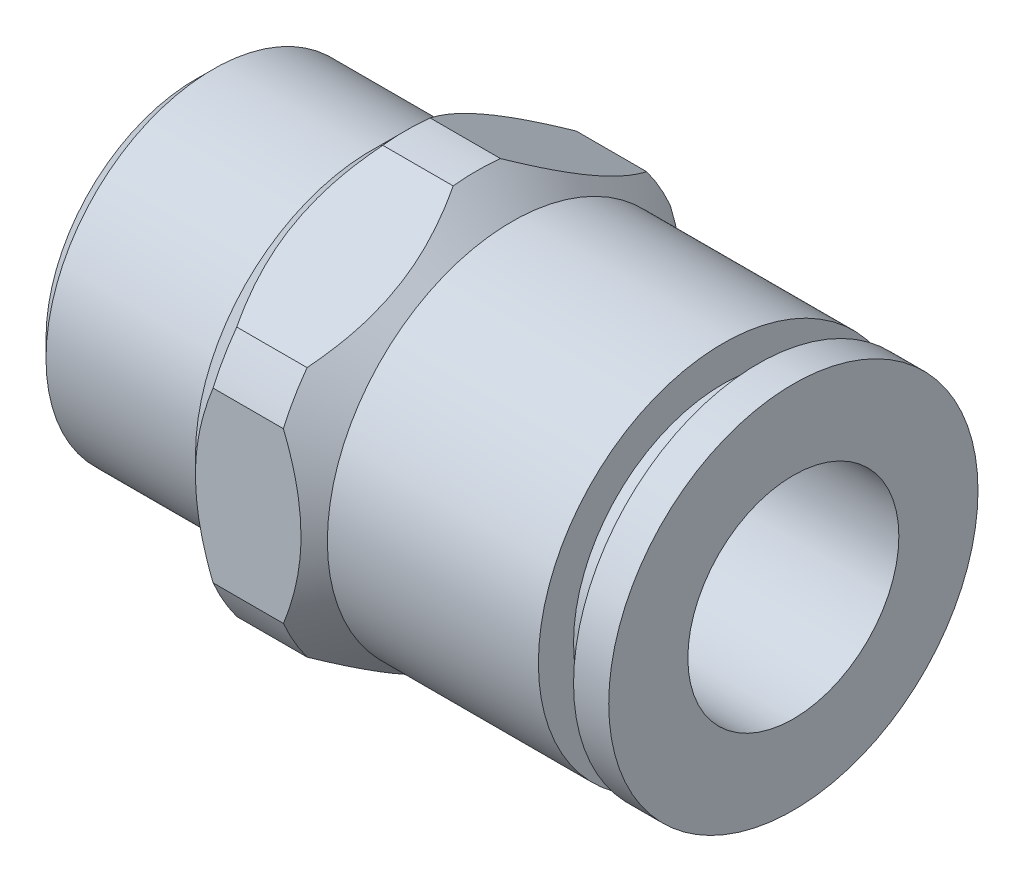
ISO-10303-21;
HEADER;
FILE_DESCRIPTION(('STEP AP214'),'2;1');
FILE_NAME('part.step','',(''),(''),'','','');
FILE_SCHEMA(('AUTOMOTIVE_DESIGN { 1 0 10303 214 1 1 1 1 }'));
ENDSEC;
DATA;
#1=APPLICATION_CONTEXT('core data for automotive mechanical design processes');
#2=APPLICATION_PROTOCOL_DEFINITION('international standard','automotive_design',2000,#1);
#3=PRODUCT_CONTEXT('',#1,'mechanical');
#4=PRODUCT('Part','Part','',(#3));
#5=PRODUCT_RELATED_PRODUCT_CATEGORY('part','',(#4));
#6=PRODUCT_DEFINITION_FORMATION('','',#4);
#7=PRODUCT_DEFINITION_CONTEXT('part definition',#1,'design');
#8=PRODUCT_DEFINITION('design','',#6,#7);
#9=PRODUCT_DEFINITION_SHAPE('','',#8);
#10=(LENGTH_UNIT() NAMED_UNIT(*) SI_UNIT(.MILLI.,.METRE.));
#11=(NAMED_UNIT(*) PLANE_ANGLE_UNIT() SI_UNIT($,.RADIAN.));
#12=(NAMED_UNIT(*) SI_UNIT($,.STERADIAN.) SOLID_ANGLE_UNIT());
#13=UNCERTAINTY_MEASURE_WITH_UNIT(LENGTH_MEASURE(1.E-05),#10,'distance_accuracy_value','');
#14=(GEOMETRIC_REPRESENTATION_CONTEXT(3) GLOBAL_UNCERTAINTY_ASSIGNED_CONTEXT((#13)) GLOBAL_UNIT_ASSIGNED_CONTEXT((#10,
#11,#12)) REPRESENTATION_CONTEXT('',''));
#15=CARTESIAN_POINT('',(0.,0.,0.));
#16=DIRECTION('',(0.,0.,1.));
#17=DIRECTION('',(1.,0.,0.));
#18=AXIS2_PLACEMENT_3D('',#15,#16,#17);
#19=CARTESIAN_POINT('',(-51.6037974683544,0.,0.));
#20=DIRECTION('',(-1.,0.,0.));
#21=DIRECTION('',(0.,0.,1.));
#22=AXIS2_PLACEMENT_3D('',#19,#20,#21);
#23=CYLINDRICAL_SURFACE('',#22,6.);
#24=CARTESIAN_POINT('',(-2.,0.,0.));
#25=DIRECTION('',(-1.,0.,0.));
#26=DIRECTION('',(0.,0.,1.));
#27=AXIS2_PLACEMENT_3D('',#24,#25,#26);
#28=CIRCLE('',#27,6.);
#29=CARTESIAN_POINT('',(-2.,-2.39791576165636,-5.5));
#30=VERTEX_POINT('',#29);
#31=CARTESIAN_POINT('',(-2.,-3.56418183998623,-4.82665596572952));
#32=VERTEX_POINT('',#31);
#33=EDGE_CURVE('E143',#30,#32,#28,.T.);
#34=ORIENTED_EDGE('',*,*,#33,.T.);
#35=DIRECTION('',(-1.,0.,0.));
#36=VECTOR('',#35,1.);
#37=CARTESIAN_POINT('',(-51.6037974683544,-3.56418183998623,-4.82665596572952));
#38=LINE('',#37,#36);
#39=CARTESIAN_POINT('',(-4.,-3.56418183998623,-4.82665596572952));
#40=VERTEX_POINT('',#39);
#41=EDGE_CURVE('E382',#32,#40,#38,.T.);
#42=ORIENTED_EDGE('',*,*,#41,.T.);
#43=CARTESIAN_POINT('',(-4.,0.,0.));
#44=DIRECTION('',(-1.,0.,0.));
#45=DIRECTION('',(0.,0.,1.));
#46=AXIS2_PLACEMENT_3D('',#43,#44,#45);
#47=CIRCLE('',#46,6.);
#48=CARTESIAN_POINT('',(-4.,-2.39791576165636,-5.5));
#49=VERTEX_POINT('',#48);
#50=EDGE_CURVE('E145',#49,#40,#47,.T.);
#51=ORIENTED_EDGE('',*,*,#50,.F.);
#52=DIRECTION('',(-1.,0.,0.));
#53=VECTOR('',#52,1.);
#54=CARTESIAN_POINT('',(-51.6037974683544,-2.39791576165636,-5.5));
#55=LINE('',#54,#53);
#56=EDGE_CURVE('E128',#49,#30,#55,.F.);
#57=ORIENTED_EDGE('',*,*,#56,.T.);
#58=EDGE_LOOP('',(#34,#42,#51,#57));
#59=FACE_BOUND('',#58,.T.);
#60=ADVANCED_FACE('F32',(#59),#23,.T.);
#61=CARTESIAN_POINT('',(-4.,-5.96209760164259,-0.67334403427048));
#62=VERTEX_POINT('',#61);
#63=CARTESIAN_POINT('',(-4.,-5.96209760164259,0.673344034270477));
#64=VERTEX_POINT('',#63);
#65=EDGE_CURVE('E319',#62,#64,#47,.T.);
#66=ORIENTED_EDGE('',*,*,#65,.F.);
#67=DIRECTION('',(-1.,0.,0.));
#68=VECTOR('',#67,1.);
#69=CARTESIAN_POINT('',(-51.6037974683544,-5.96209760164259,-0.67334403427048));
#70=LINE('',#69,#68);
#71=CARTESIAN_POINT('',(-2.,-5.96209760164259,-0.673344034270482));
#72=VERTEX_POINT('',#71);
#73=EDGE_CURVE('E247',#62,#72,#70,.F.);
#74=ORIENTED_EDGE('',*,*,#73,.T.);
#75=CARTESIAN_POINT('',(-2.,-5.96209760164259,0.673344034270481));
#76=VERTEX_POINT('',#75);
#77=EDGE_CURVE('E151',#72,#76,#28,.T.);
#78=ORIENTED_EDGE('',*,*,#77,.T.);
#79=DIRECTION('',(-1.,0.,0.));
#80=VECTOR('',#79,1.);
#81=CARTESIAN_POINT('',(-51.6037974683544,-5.96209760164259,0.673344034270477));
#82=LINE('',#81,#80);
#83=EDGE_CURVE('E60',#76,#64,#82,.T.);
#84=ORIENTED_EDGE('',*,*,#83,.T.);
#85=EDGE_LOOP('',(#66,#74,#78,#84));
#86=FACE_BOUND('',#85,.T.);
#87=ADVANCED_FACE('F282',(#86),#23,.T.);
#88=CARTESIAN_POINT('',(-4.,-3.56418183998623,4.82665596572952));
#89=VERTEX_POINT('',#88);
#90=CARTESIAN_POINT('',(-4.,-2.39791576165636,5.5));
#91=VERTEX_POINT('',#90);
#92=EDGE_CURVE('E160',#89,#91,#47,.T.);
#93=ORIENTED_EDGE('',*,*,#92,.F.);
#94=DIRECTION('',(-1.,0.,0.));
#95=VECTOR('',#94,1.);
#96=CARTESIAN_POINT('',(-51.6037974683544,-3.56418183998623,4.82665596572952));
#97=LINE('',#96,#95);
#98=CARTESIAN_POINT('',(-2.,-3.56418183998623,4.82665596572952));
#99=VERTEX_POINT('',#98);
#100=EDGE_CURVE('E330',#89,#99,#97,.F.);
#101=ORIENTED_EDGE('',*,*,#100,.T.);
#102=CARTESIAN_POINT('',(-2.,-2.39791576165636,5.5));
#103=VERTEX_POINT('',#102);
#104=EDGE_CURVE('E155',#99,#103,#28,.T.);
#105=ORIENTED_EDGE('',*,*,#104,.T.);
#106=DIRECTION('',(-1.,0.,0.));
#107=VECTOR('',#106,1.);
#108=CARTESIAN_POINT('',(-51.6037974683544,-2.39791576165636,5.5));
#109=LINE('',#108,#107);
#110=EDGE_CURVE('E52',#103,#91,#109,.T.);
#111=ORIENTED_EDGE('',*,*,#110,.T.);
#112=EDGE_LOOP('',(#93,#101,#105,#111));
#113=FACE_BOUND('',#112,.T.);
#114=ADVANCED_FACE('F286',(#113),#23,.T.);
#115=CARTESIAN_POINT('',(-4.,2.39791576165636,5.5));
#116=VERTEX_POINT('',#115);
#117=CARTESIAN_POINT('',(-4.,3.56418183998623,4.82665596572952));
#118=VERTEX_POINT('',#117);
#119=EDGE_CURVE('E163',#116,#118,#47,.T.);
#120=ORIENTED_EDGE('',*,*,#119,.F.);
#121=DIRECTION('',(-1.,0.,0.));
#122=VECTOR('',#121,1.);
#123=CARTESIAN_POINT('',(-51.6037974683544,2.39791576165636,5.5));
#124=LINE('',#123,#122);
#125=CARTESIAN_POINT('',(-1.99999999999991,2.39791576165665,5.5));
#126=VERTEX_POINT('',#125);
#127=EDGE_CURVE('E332',#116,#126,#124,.F.);
#128=ORIENTED_EDGE('',*,*,#127,.T.);
#129=CARTESIAN_POINT('',(-2.,3.56418183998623,4.82665596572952));
#130=VERTEX_POINT('',#129);
#131=EDGE_CURVE('E156',#126,#130,#28,.T.);
#132=ORIENTED_EDGE('',*,*,#131,.T.);
#133=DIRECTION('',(-1.,0.,0.));
#134=VECTOR('',#133,1.);
#135=CARTESIAN_POINT('',(-51.6037974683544,3.56418183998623,4.82665596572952));
#136=LINE('',#135,#134);
#137=EDGE_CURVE('E335',#130,#118,#136,.T.);
#138=ORIENTED_EDGE('',*,*,#137,.T.);
#139=EDGE_LOOP('',(#120,#128,#132,#138));
#140=FACE_BOUND('',#139,.T.);
#141=ADVANCED_FACE('F297',(#140),#23,.T.);
#142=CARTESIAN_POINT('',(-4.,5.96209760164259,0.673344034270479));
#143=VERTEX_POINT('',#142);
#144=CARTESIAN_POINT('',(-4.,5.96209760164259,-0.673344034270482));
#145=VERTEX_POINT('',#144);
#146=EDGE_CURVE('E167',#143,#145,#47,.T.);
#147=ORIENTED_EDGE('',*,*,#146,.F.);
#148=DIRECTION('',(-1.,0.,0.));
#149=VECTOR('',#148,1.);
#150=CARTESIAN_POINT('',(-51.6037974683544,5.96209760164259,0.673344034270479));
#151=LINE('',#150,#149);
#152=CARTESIAN_POINT('',(-2.,5.96209760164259,0.673344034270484));
#153=VERTEX_POINT('',#152);
#154=EDGE_CURVE('E311',#143,#153,#151,.F.);
#155=ORIENTED_EDGE('',*,*,#154,.T.);
#156=CARTESIAN_POINT('',(-2.,5.96209760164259,-0.673344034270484));
#157=VERTEX_POINT('',#156);
#158=EDGE_CURVE('E153',#153,#157,#28,.T.);
#159=ORIENTED_EDGE('',*,*,#158,.T.);
#160=DIRECTION('',(-1.,0.,0.));
#161=VECTOR('',#160,1.);
#162=CARTESIAN_POINT('',(-51.6037974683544,5.96209760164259,-0.673344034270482));
#163=LINE('',#162,#161);
#164=EDGE_CURVE('E313',#157,#145,#163,.T.);
#165=ORIENTED_EDGE('',*,*,#164,.T.);
#166=EDGE_LOOP('',(#147,#155,#159,#165));
#167=FACE_BOUND('',#166,.T.);
#168=ADVANCED_FACE('F290',(#167),#23,.T.);
#169=CARTESIAN_POINT('',(-9.5,0.,0.));
#170=DIRECTION('',(1.,0.,0.));
#171=DIRECTION('',(0.,0.,-1.));
#172=AXIS2_PLACEMENT_3D('',#169,#170,#171);
#173=CONICAL_SURFACE('',#172,4.75,0.785398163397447);
#174=CARTESIAN_POINT('',(-10.,0.,0.));
#175=DIRECTION('',(-1.,0.,0.));
#176=DIRECTION('',(0.,0.,1.));
#177=AXIS2_PLACEMENT_3D('',#174,#175,#176);
#178=CIRCLE('',#177,4.25);
#179=CARTESIAN_POINT('',(-10.,0.,4.25));
#180=VERTEX_POINT('',#179);
#181=EDGE_CURVE('E376',#180,#180,#178,.T.);
#182=ORIENTED_EDGE('',*,*,#181,.F.);
#183=EDGE_LOOP('',(#182));
#184=FACE_BOUND('',#183,.T.);
#185=CARTESIAN_POINT('',(-9.5,0.,0.));
#186=DIRECTION('',(-1.,0.,0.));
#187=DIRECTION('',(0.,0.,1.));
#188=AXIS2_PLACEMENT_3D('',#185,#186,#187);
#189=CIRCLE('',#188,4.75);
#190=CARTESIAN_POINT('',(-9.5,0.,4.75));
#191=VERTEX_POINT('',#190);
#192=EDGE_CURVE('E137',#191,#191,#189,.T.);
#193=ORIENTED_EDGE('',*,*,#192,.T.);
#194=EDGE_LOOP('',(#193));
#195=FACE_BOUND('',#194,.T.);
#196=ADVANCED_FACE('F34',(#184,#195),#173,.T.);
#197=CARTESIAN_POINT('',(-51.6037974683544,0.,0.));
#198=DIRECTION('',(-1.,0.,0.));
#199=DIRECTION('',(0.,0.,1.));
#200=AXIS2_PLACEMENT_3D('',#197,#198,#199);
#201=CYLINDRICAL_SURFACE('',#200,4.75);
#202=ORIENTED_EDGE('',*,*,#192,.F.);
#203=EDGE_LOOP('',(#202));
#204=FACE_BOUND('',#203,.T.);
#205=CARTESIAN_POINT('',(-5.,0.,0.));
#206=DIRECTION('',(-1.,0.,0.));
#207=DIRECTION('',(0.,0.,1.));
#208=AXIS2_PLACEMENT_3D('',#205,#206,#207);
#209=CIRCLE('',#208,4.75);
#210=CARTESIAN_POINT('',(-5.,0.,4.75));
#211=VERTEX_POINT('',#210);
#212=EDGE_CURVE('E170',#211,#211,#209,.T.);
#213=ORIENTED_EDGE('',*,*,#212,.T.);
#214=EDGE_LOOP('',(#213));
#215=FACE_BOUND('',#214,.T.);
#216=ADVANCED_FACE('F303',(#204,#215),#201,.T.);
#217=CARTESIAN_POINT('',(-5.,4.75,0.));
#218=DIRECTION('',(1.,0.,0.));
#219=DIRECTION('',(0.,0.,-1.));
#220=AXIS2_PLACEMENT_3D('',#217,#218,#219);
#221=PLANE('',#220);
#222=ORIENTED_EDGE('',*,*,#212,.F.);
#223=EDGE_LOOP('',(#222));
#224=FACE_BOUND('',#223,.T.);
#225=CARTESIAN_POINT('',(-5.,0.,0.));
#226=DIRECTION('',(-1.,0.,0.));
#227=DIRECTION('',(0.,0.,1.));
#228=AXIS2_PLACEMENT_3D('',#225,#226,#227);
#229=CIRCLE('',#228,5.);
#230=CARTESIAN_POINT('',(-5.,0.,5.));
#231=VERTEX_POINT('',#230);
#232=EDGE_CURVE('E166',#231,#231,#229,.T.);
#233=ORIENTED_EDGE('',*,*,#232,.T.);
#234=EDGE_LOOP('',(#233));
#235=FACE_BOUND('',#234,.T.);
#236=ADVANCED_FACE('F209',(#224,#235),#221,.F.);
#237=CARTESIAN_POINT('',(-4.,0.,0.));
#238=DIRECTION('',(1.,0.,0.));
#239=DIRECTION('',(0.,0.,-1.));
#240=AXIS2_PLACEMENT_3D('',#237,#238,#239);
#241=CONICAL_SURFACE('',#240,6.,0.785398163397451);
#242=ORIENTED_EDGE('',*,*,#232,.F.);
#243=EDGE_LOOP('',(#242));
#244=FACE_BOUND('',#243,.T.);
#245=ORIENTED_EDGE('',*,*,#50,.T.);
#246=CARTESIAN_POINT('',(-3.9998,-3.56393164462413,-4.82708931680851));
#247=CARTESIAN_POINT('',(-4.07219303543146,-3.65445423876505,-4.67029958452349));
#248=CARTESIAN_POINT('',(-4.13869120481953,-3.74627003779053,-4.51126995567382));
#249=CARTESIAN_POINT('',(-4.25726837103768,-3.93246008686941,-4.18877933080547));
#250=CARTESIAN_POINT('',(-4.30930750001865,-4.02684063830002,-4.02530742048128));
#251=CARTESIAN_POINT('',(-4.39552684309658,-4.21678816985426,-3.69630864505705));
#252=CARTESIAN_POINT('',(-4.42986145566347,-4.31233718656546,-3.53081289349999));
#253=CARTESIAN_POINT('',(-4.47902929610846,-4.50459316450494,-3.19781577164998));
#254=CARTESIAN_POINT('',(-4.49388518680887,-4.6012986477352,-3.03031696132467));
#255=CARTESIAN_POINT('',(-4.50284613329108,-4.7908272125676,-2.70204385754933));
#256=CARTESIAN_POINT('',(-4.49780830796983,-4.88364016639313,-2.54128710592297));
#257=CARTESIAN_POINT('',(-4.46925381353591,-5.06858476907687,-2.2209536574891));
#258=CARTESIAN_POINT('',(-4.44572825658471,-5.16071606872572,-2.06137756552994));
#259=CARTESIAN_POINT('',(-4.38178533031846,-5.34337375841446,-1.74500516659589));
#260=CARTESIAN_POINT('',(-4.34138519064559,-5.43390168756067,-1.58820619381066));
#261=CARTESIAN_POINT('',(-4.24593882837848,-5.61300041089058,-1.27799810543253));
#262=CARTESIAN_POINT('',(-4.19089041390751,-5.70157091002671,-1.12458950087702));
#263=CARTESIAN_POINT('',(-4.10936644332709,-5.81819305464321,-0.922594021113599));
#264=CARTESIAN_POINT('',(-4.08831175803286,-5.84722146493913,-0.872315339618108));
#265=CARTESIAN_POINT('',(-4.04496789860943,-5.90498765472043,-0.772261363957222));
#266=CARTESIAN_POINT('',(-4.02268100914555,-5.93372586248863,-0.722485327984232));
#267=CARTESIAN_POINT('',(-3.99979999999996,-5.96234779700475,-0.672910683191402));
#268=B_SPLINE_CURVE_WITH_KNOTS('',3,(#246,#247,#248,#249,#250,#251,#252,#253,#254,#255,#256,
#257,#258,#259,#260,#261,#262,#263,#264,#265,#266,#267),.UNSPECIFIED.,.F.,.F.,(4,2,2,2,2,2,2,2,
2,2,4),(0.,0.58516480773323,1.17192742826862,1.75348254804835,2.33436044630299,2.89049016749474,
3.4468874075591,4.00271792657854,4.55863166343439,4.74389307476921,4.92882181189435),.UNSPECIFIED.);
#269=EDGE_CURVE('E378',#40,#62,#268,.T.);
#270=ORIENTED_EDGE('',*,*,#269,.T.);
#271=ORIENTED_EDGE('',*,*,#65,.T.);
#272=CARTESIAN_POINT('',(-3.99979999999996,-5.96234779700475,0.672910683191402));
#273=CARTESIAN_POINT('',(-4.07219303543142,-5.87182520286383,0.82970041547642));
#274=CARTESIAN_POINT('',(-4.13869120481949,-5.78000940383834,0.988730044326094));
#275=CARTESIAN_POINT('',(-4.25726837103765,-5.59381935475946,1.31122066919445));
#276=CARTESIAN_POINT('',(-4.30930750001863,-5.49943880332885,1.47469257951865));
#277=CARTESIAN_POINT('',(-4.39552684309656,-5.30949127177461,1.80369135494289));
#278=CARTESIAN_POINT('',(-4.42986145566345,-5.2139422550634,1.96918710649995));
#279=CARTESIAN_POINT('',(-4.47902929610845,-5.02168627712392,2.30218422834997));
#280=CARTESIAN_POINT('',(-4.49388518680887,-4.92498079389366,2.46968303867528));
#281=CARTESIAN_POINT('',(-4.50284613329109,-4.73545222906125,2.79795614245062));
#282=CARTESIAN_POINT('',(-4.49780830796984,-4.64263927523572,2.95871289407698));
#283=CARTESIAN_POINT('',(-4.46925381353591,-4.45769467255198,3.27904634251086));
#284=CARTESIAN_POINT('',(-4.44572825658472,-4.36556337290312,3.43862243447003));
#285=CARTESIAN_POINT('',(-4.38178533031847,-4.18290568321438,3.75499483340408));
#286=CARTESIAN_POINT('',(-4.3413851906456,-4.09237775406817,3.91179380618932));
#287=CARTESIAN_POINT('',(-4.24593882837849,-3.91327903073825,4.22200189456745));
#288=CARTESIAN_POINT('',(-4.19089041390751,-3.82470853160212,4.37541049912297));
#289=CARTESIAN_POINT('',(-4.1093664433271,-3.70808638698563,4.57740597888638));
#290=CARTESIAN_POINT('',(-4.08831175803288,-3.67905797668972,4.62768466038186));
#291=CARTESIAN_POINT('',(-4.04496789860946,-3.62129178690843,4.72773863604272));
#292=CARTESIAN_POINT('',(-4.02268100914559,-3.59255357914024,4.77751467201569));
#293=CARTESIAN_POINT('',(-3.9998,-3.56393164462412,4.82708931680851));
#294=B_SPLINE_CURVE_WITH_KNOTS('',3,(#272,#273,#274,#275,#276,#277,#278,#279,#280,#281,#282,
#283,#284,#285,#286,#287,#288,#289,#290,#291,#292,#293),.UNSPECIFIED.,.F.,.F.,(4,2,2,2,2,2,2,2,
2,2,4),(0.,0.585164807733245,1.17192742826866,1.75348254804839,2.33436044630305,
2.89049016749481,3.44688740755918,4.00271792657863,4.55863166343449,4.74389307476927,
4.92882181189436),.UNSPECIFIED.);
#295=EDGE_CURVE('E239',#64,#89,#294,.T.);
#296=ORIENTED_EDGE('',*,*,#295,.T.);
#297=ORIENTED_EDGE('',*,*,#92,.T.);
#298=CARTESIAN_POINT('',(-1.64579689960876,-6.28829940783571,5.5));
#299=CARTESIAN_POINT('',(-1.76117382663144,-6.13498261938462,5.5));
#300=CARTESIAN_POINT('',(-1.875422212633,-5.98080243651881,5.5));
#301=CARTESIAN_POINT('',(-2.10115824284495,-5.67037664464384,5.5));
#302=CARTESIAN_POINT('',(-2.21264518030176,-5.51413052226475,5.5));
#303=CARTESIAN_POINT('',(-2.43314691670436,-5.19809150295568,5.5));
#304=CARTESIAN_POINT('',(-2.54213585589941,-5.03828050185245,5.5));
#305=CARTESIAN_POINT('',(-2.75600088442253,-4.71593824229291,5.5));
#306=CARTESIAN_POINT('',(-2.86087726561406,-4.55340717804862,5.5));
#307=CARTESIAN_POINT('',(-3.07136049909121,-4.21597063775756,5.5));
#308=CARTESIAN_POINT('',(-3.17667702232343,-4.04088313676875,5.5));
#309=CARTESIAN_POINT('',(-3.38031733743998,-3.6866262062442,5.5));
#310=CARTESIAN_POINT('',(-3.47864003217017,-3.50745614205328,5.5));
#311=CARTESIAN_POINT('',(-3.66616710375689,-3.14506095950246,5.5));
#312=CARTESIAN_POINT('',(-3.75539829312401,-2.96184982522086,5.5));
#313=CARTESIAN_POINT('',(-3.92274518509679,-2.59046033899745,5.5));
#314=CARTESIAN_POINT('',(-4.00086588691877,-2.40228426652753,5.5));
#315=CARTESIAN_POINT('',(-4.13770195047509,-2.03548146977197,5.5));
#316=CARTESIAN_POINT('',(-4.19745196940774,-1.85724478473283,5.5));
#317=CARTESIAN_POINT('',(-4.30264655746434,-1.4965193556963,5.5));
#318=CARTESIAN_POINT('',(-4.34809012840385,-1.31403031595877,5.5));
#319=CARTESIAN_POINT('',(-4.42155552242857,-0.948903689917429,5.5));
#320=CARTESIAN_POINT('',(-4.44987312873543,-0.766326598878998,5.5));
#321=CARTESIAN_POINT('',(-4.48854401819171,-0.399269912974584,5.5));
#322=CARTESIAN_POINT('',(-4.49890029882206,-0.214790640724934,5.5));
#323=CARTESIAN_POINT('',(-4.50089747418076,0.147781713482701,5.5));
#324=CARTESIAN_POINT('',(-4.49318303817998,0.325871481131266,5.5));
#325=CARTESIAN_POINT('',(-4.46087695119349,0.680503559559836,5.5));
#326=CARTESIAN_POINT('',(-4.43628364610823,0.857045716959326,5.5));
#327=CARTESIAN_POINT('',(-4.37113566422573,1.21028891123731,5.5));
#328=CARTESIAN_POINT('',(-4.33031090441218,1.3869393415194,5.5));
#329=CARTESIAN_POINT('',(-4.23486388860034,1.73639662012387,5.5));
#330=CARTESIAN_POINT('',(-4.18024284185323,1.90920380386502,5.5));
#331=CARTESIAN_POINT('',(-4.05345327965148,2.26765659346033,5.5));
#332=CARTESIAN_POINT('',(-3.98008055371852,2.45287200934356,5.5));
#333=CARTESIAN_POINT('',(-3.82208430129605,2.81848286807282,5.5));
#334=CARTESIAN_POINT('',(-3.73745550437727,2.99887600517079,5.5));
#335=CARTESIAN_POINT('',(-3.5589619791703,3.35572933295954,5.5));
#336=CARTESIAN_POINT('',(-3.46506815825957,3.53217485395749,5.5));
#337=CARTESIAN_POINT('',(-3.27012148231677,3.88100218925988,5.5));
#338=CARTESIAN_POINT('',(-3.1690697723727,4.05338464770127,5.5));
#339=CARTESIAN_POINT('',(-2.96639858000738,4.38612269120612,5.5));
#340=CARTESIAN_POINT('',(-2.8650585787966,4.5466494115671,5.5));
#341=CARTESIAN_POINT('',(-2.65812699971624,4.86494746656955,5.5));
#342=CARTESIAN_POINT('',(-2.55253509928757,5.02271859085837,5.5));
#343=CARTESIAN_POINT('',(-2.33873447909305,5.33458489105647,5.5));
#344=CARTESIAN_POINT('',(-2.23055405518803,5.48869953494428,5.5));
#345=CARTESIAN_POINT('',(-2.01133980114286,5.79482426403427,5.5));
#346=CARTESIAN_POINT('',(-1.90030676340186,5.94683491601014,5.5));
#347=CARTESIAN_POINT('',(-1.78810771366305,6.09796481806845,5.5));
#348=B_SPLINE_CURVE_WITH_KNOTS('',3,(#298,#299,#300,#301,#302,#303,#304,#305,#306,#307,#308,
#309,#310,#311,#312,#313,#314,#315,#316,#317,#318,#319,#320,#321,#322,#323,#324,#325,#326,#327,
#328,#329,#330,#331,#332,#333,#334,#335,#336,#337,#338,#339,#340,#341,#342,#343,#344,#345,#346,
#347),.UNSPECIFIED.,.F.,.F.,(4,2,2,2,2,2,2,2,2,2,2,2,2,2,2,2,2,2,2,2,2,2,2,2,4),(0.,
0.575651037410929,1.15144791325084,1.73170783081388,2.31192649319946,2.92476056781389,
3.53769056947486,4.14875715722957,4.75954791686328,5.3230060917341,5.88650357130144,
6.4399681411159,6.99334033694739,7.52727322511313,8.06125844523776,8.60452797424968,
9.14774990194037,9.74494111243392,10.3424129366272,10.9418244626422,11.541140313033,
12.1105767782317,12.6800565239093,13.2449009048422,13.8095900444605),.UNSPECIFIED.);
#349=EDGE_CURVE('E231',#91,#116,#348,.T.);
#350=ORIENTED_EDGE('',*,*,#349,.T.);
#351=ORIENTED_EDGE('',*,*,#119,.T.);
#352=CARTESIAN_POINT('',(-3.9998,3.56393164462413,4.82708931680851));
#353=CARTESIAN_POINT('',(-4.07219303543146,3.65445423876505,4.67029958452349));
#354=CARTESIAN_POINT('',(-4.13869120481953,3.74627003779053,4.51126995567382));
#355=CARTESIAN_POINT('',(-4.25726837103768,3.93246008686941,4.18877933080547));
#356=CARTESIAN_POINT('',(-4.30930750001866,4.02684063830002,4.02530742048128));
#357=CARTESIAN_POINT('',(-4.39552684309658,4.21678816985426,3.69630864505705));
#358=CARTESIAN_POINT('',(-4.42986145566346,4.31233718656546,3.53081289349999));
#359=CARTESIAN_POINT('',(-4.47902929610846,4.50459316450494,3.19781577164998));
#360=CARTESIAN_POINT('',(-4.49388518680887,4.6012986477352,3.03031696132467));
#361=CARTESIAN_POINT('',(-4.50284613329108,4.7908272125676,2.70204385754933));
#362=CARTESIAN_POINT('',(-4.49780830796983,4.88364016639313,2.54128710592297));
#363=CARTESIAN_POINT('',(-4.46925381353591,5.06858476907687,2.2209536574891));
#364=CARTESIAN_POINT('',(-4.44572825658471,5.16071606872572,2.06137756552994));
#365=CARTESIAN_POINT('',(-4.38178533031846,5.34337375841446,1.74500516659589));
#366=CARTESIAN_POINT('',(-4.34138519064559,5.43390168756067,1.58820619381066));
#367=CARTESIAN_POINT('',(-4.24593882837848,5.61300041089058,1.27799810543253));
#368=CARTESIAN_POINT('',(-4.19089041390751,5.70157091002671,1.12458950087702));
#369=CARTESIAN_POINT('',(-4.10936644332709,5.81819305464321,0.9225940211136));
#370=CARTESIAN_POINT('',(-4.08831175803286,5.84722146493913,0.872315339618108));
#371=CARTESIAN_POINT('',(-4.04496789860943,5.90498765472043,0.772261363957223));
#372=CARTESIAN_POINT('',(-4.02268100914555,5.93372586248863,0.722485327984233));
#373=CARTESIAN_POINT('',(-3.99979999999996,5.96234779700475,0.672910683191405));
#374=B_SPLINE_CURVE_WITH_KNOTS('',3,(#352,#353,#354,#355,#356,#357,#358,#359,#360,#361,#362,
#363,#364,#365,#366,#367,#368,#369,#370,#371,#372,#373),.UNSPECIFIED.,.F.,.F.,(4,2,2,2,2,2,2,2,
2,2,4),(0.,0.585164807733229,1.17192742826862,1.75348254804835,2.33436044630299,
2.89049016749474,3.4468874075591,4.00271792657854,4.55863166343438,4.74389307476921,
4.92882181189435),.UNSPECIFIED.);
#375=EDGE_CURVE('E224',#118,#143,#374,.T.);
#376=ORIENTED_EDGE('',*,*,#375,.T.);
#377=ORIENTED_EDGE('',*,*,#146,.T.);
#378=CARTESIAN_POINT('',(-3.99979999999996,5.96234779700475,-0.672910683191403));
#379=CARTESIAN_POINT('',(-4.07219303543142,5.87182520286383,-0.829700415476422));
#380=CARTESIAN_POINT('',(-4.13869120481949,5.78000940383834,-0.988730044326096));
#381=CARTESIAN_POINT('',(-4.25726837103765,5.59381935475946,-1.31122066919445));
#382=CARTESIAN_POINT('',(-4.30930750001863,5.49943880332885,-1.47469257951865));
#383=CARTESIAN_POINT('',(-4.39552684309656,5.30949127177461,-1.80369135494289));
#384=CARTESIAN_POINT('',(-4.42986145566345,5.2139422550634,-1.96918710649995));
#385=CARTESIAN_POINT('',(-4.47902929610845,5.02168627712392,-2.30218422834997));
#386=CARTESIAN_POINT('',(-4.49388518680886,4.92498079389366,-2.46968303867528));
#387=CARTESIAN_POINT('',(-4.50284613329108,4.73545222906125,-2.79795614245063));
#388=CARTESIAN_POINT('',(-4.49780830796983,4.64263927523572,-2.95871289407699));
#389=CARTESIAN_POINT('',(-4.46925381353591,4.45769467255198,-3.27904634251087));
#390=CARTESIAN_POINT('',(-4.44572825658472,4.36556337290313,-3.43862243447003));
#391=CARTESIAN_POINT('',(-4.38178533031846,4.18290568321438,-3.75499483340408));
#392=CARTESIAN_POINT('',(-4.3413851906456,4.09237775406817,-3.91179380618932));
#393=CARTESIAN_POINT('',(-4.24593882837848,3.91327903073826,-4.22200189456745));
#394=CARTESIAN_POINT('',(-4.19089041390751,3.82470853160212,-4.37541049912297));
#395=CARTESIAN_POINT('',(-4.1093664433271,3.70808638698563,-4.57740597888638));
#396=CARTESIAN_POINT('',(-4.08831175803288,3.67905797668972,-4.62768466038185));
#397=CARTESIAN_POINT('',(-4.04496789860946,3.62129178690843,-4.72773863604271));
#398=CARTESIAN_POINT('',(-4.02268100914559,3.59255357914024,-4.77751467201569));
#399=CARTESIAN_POINT('',(-3.9998,3.56393164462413,-4.82708931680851));
#400=B_SPLINE_CURVE_WITH_KNOTS('',3,(#378,#379,#380,#381,#382,#383,#384,#385,#386,#387,#388,
#389,#390,#391,#392,#393,#394,#395,#396,#397,#398,#399),.UNSPECIFIED.,.F.,.F.,(4,2,2,2,2,2,2,2,
2,2,4),(0.,0.585164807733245,1.17192742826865,1.75348254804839,2.33436044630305,
2.89049016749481,3.44688740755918,4.00271792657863,4.55863166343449,4.74389307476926,
4.92882181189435),.UNSPECIFIED.);
#401=CARTESIAN_POINT('',(-4.,3.56418183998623,-4.82665596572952));
#402=VERTEX_POINT('',#401);
#403=EDGE_CURVE('E217',#145,#402,#400,.T.);
#404=ORIENTED_EDGE('',*,*,#403,.T.);
#405=CARTESIAN_POINT('',(-4.,2.39791576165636,-5.5));
#406=VERTEX_POINT('',#405);
#407=EDGE_CURVE('E317',#402,#406,#47,.T.);
#408=ORIENTED_EDGE('',*,*,#407,.T.);
#409=CARTESIAN_POINT('',(-1.64579689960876,-6.28829940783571,-5.5));
#410=CARTESIAN_POINT('',(-1.76117382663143,-6.13498261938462,-5.5));
#411=CARTESIAN_POINT('',(-1.87542221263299,-5.98080243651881,-5.5));
#412=CARTESIAN_POINT('',(-2.10115824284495,-5.67037664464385,-5.5));
#413=CARTESIAN_POINT('',(-2.21264518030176,-5.51413052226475,-5.5));
#414=CARTESIAN_POINT('',(-2.43314691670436,-5.19809150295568,-5.5));
#415=CARTESIAN_POINT('',(-2.54213585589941,-5.03828050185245,-5.5));
#416=CARTESIAN_POINT('',(-2.75600088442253,-4.71593824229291,-5.5));
#417=CARTESIAN_POINT('',(-2.86087726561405,-4.55340717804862,-5.5));
#418=CARTESIAN_POINT('',(-3.07136049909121,-4.21597063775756,-5.5));
#419=CARTESIAN_POINT('',(-3.17667702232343,-4.04088313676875,-5.5));
#420=CARTESIAN_POINT('',(-3.38031733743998,-3.6866262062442,-5.5));
#421=CARTESIAN_POINT('',(-3.47864003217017,-3.50745614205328,-5.5));
#422=CARTESIAN_POINT('',(-3.66616710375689,-3.14506095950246,-5.5));
#423=CARTESIAN_POINT('',(-3.75539829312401,-2.96184982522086,-5.5));
#424=CARTESIAN_POINT('',(-3.92274518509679,-2.59046033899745,-5.5));
#425=CARTESIAN_POINT('',(-4.00086588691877,-2.40228426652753,-5.5));
#426=CARTESIAN_POINT('',(-4.13770195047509,-2.03548146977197,-5.5));
#427=CARTESIAN_POINT('',(-4.19745196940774,-1.85724478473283,-5.5));
#428=CARTESIAN_POINT('',(-4.30264655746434,-1.4965193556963,-5.5));
#429=CARTESIAN_POINT('',(-4.34809012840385,-1.31403031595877,-5.5));
#430=CARTESIAN_POINT('',(-4.42155552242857,-0.948903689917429,-5.5));
#431=CARTESIAN_POINT('',(-4.44987312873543,-0.766326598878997,-5.5));
#432=CARTESIAN_POINT('',(-4.48854401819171,-0.399269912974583,-5.5));
#433=CARTESIAN_POINT('',(-4.49890029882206,-0.214790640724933,-5.5));
#434=CARTESIAN_POINT('',(-4.50089747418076,0.147781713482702,-5.5));
#435=CARTESIAN_POINT('',(-4.49318303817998,0.325871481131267,-5.5));
#436=CARTESIAN_POINT('',(-4.46087695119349,0.680503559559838,-5.5));
#437=CARTESIAN_POINT('',(-4.43628364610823,0.857045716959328,-5.5));
#438=CARTESIAN_POINT('',(-4.37113566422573,1.21028891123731,-5.5));
#439=CARTESIAN_POINT('',(-4.33031090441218,1.3869393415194,-5.5));
#440=CARTESIAN_POINT('',(-4.23486388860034,1.73639662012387,-5.5));
#441=CARTESIAN_POINT('',(-4.18024284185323,1.90920380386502,-5.5));
#442=CARTESIAN_POINT('',(-4.05345327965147,2.26765659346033,-5.5));
#443=CARTESIAN_POINT('',(-3.98008055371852,2.45287200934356,-5.5));
#444=CARTESIAN_POINT('',(-3.82208430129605,2.81848286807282,-5.5));
#445=CARTESIAN_POINT('',(-3.73745550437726,2.99887600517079,-5.5));
#446=CARTESIAN_POINT('',(-3.5589619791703,3.35572933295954,-5.5));
#447=CARTESIAN_POINT('',(-3.46506815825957,3.5321748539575,-5.5));
#448=CARTESIAN_POINT('',(-3.27012148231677,3.88100218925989,-5.5));
#449=CARTESIAN_POINT('',(-3.1690697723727,4.05338464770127,-5.5));
#450=CARTESIAN_POINT('',(-2.96639858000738,4.38612269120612,-5.5));
#451=CARTESIAN_POINT('',(-2.86505857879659,4.5466494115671,-5.5));
#452=CARTESIAN_POINT('',(-2.65812699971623,4.86494746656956,-5.5));
#453=CARTESIAN_POINT('',(-2.55253509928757,5.02271859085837,-5.5));
#454=CARTESIAN_POINT('',(-2.33873447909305,5.33458489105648,-5.5));
#455=CARTESIAN_POINT('',(-2.23055405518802,5.48869953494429,-5.5));
#456=CARTESIAN_POINT('',(-2.01133980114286,5.79482426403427,-5.5));
#457=CARTESIAN_POINT('',(-1.90030676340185,5.94683491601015,-5.5));
#458=CARTESIAN_POINT('',(-1.78810771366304,6.09796481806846,-5.5));
#459=B_SPLINE_CURVE_WITH_KNOTS('',3,(#409,#410,#411,#412,#413,#414,#415,#416,#417,#418,#419,
#420,#421,#422,#423,#424,#425,#426,#427,#428,#429,#430,#431,#432,#433,#434,#435,#436,#437,#438,
#439,#440,#441,#442,#443,#444,#445,#446,#447,#448,#449,#450,#451,#452,#453,#454,#455,#456,#457,
#458),.UNSPECIFIED.,.F.,.F.,(4,2,2,2,2,2,2,2,2,2,2,2,2,2,2,2,2,2,2,2,2,2,2,2,4),(0.,
0.57565103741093,1.15144791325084,1.73170783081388,2.31192649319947,2.92476056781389,
3.53769056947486,4.14875715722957,4.75954791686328,5.32300609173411,5.88650357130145,
6.43996814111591,6.99334033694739,7.52727322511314,8.06125844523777,8.60452797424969,
9.14774990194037,9.74494111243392,10.3424129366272,10.9418244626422,11.541140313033,
12.1105767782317,12.6800565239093,13.2449009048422,13.8095900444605),.UNSPECIFIED.);
#460=EDGE_CURVE('E195',#406,#49,#459,.F.);
#461=ORIENTED_EDGE('',*,*,#460,.T.);
#462=EDGE_LOOP('',(#245,#270,#271,#296,#297,#350,#351,#376,#377,#404,#408,#461));
#463=FACE_BOUND('',#462,.T.);
#464=ADVANCED_FACE('F204',(#244,#463),#241,.T.);
#465=ORIENTED_EDGE('',*,*,#407,.F.);
#466=DIRECTION('',(-1.,0.,0.));
#467=VECTOR('',#466,1.);
#468=CARTESIAN_POINT('',(-51.6037974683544,3.56418183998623,-4.82665596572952));
#469=LINE('',#468,#467);
#470=CARTESIAN_POINT('',(-2.,3.56418183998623,-4.82665596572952));
#471=VERTEX_POINT('',#470);
#472=EDGE_CURVE('E202',#402,#471,#469,.F.);
#473=ORIENTED_EDGE('',*,*,#472,.T.);
#474=CARTESIAN_POINT('',(-2.,2.39791576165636,-5.5));
#475=VERTEX_POINT('',#474);
#476=EDGE_CURVE('E150',#471,#475,#28,.T.);
#477=ORIENTED_EDGE('',*,*,#476,.T.);
#478=DIRECTION('',(-1.,0.,0.));
#479=VECTOR('',#478,1.);
#480=CARTESIAN_POINT('',(-51.6037974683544,2.39791576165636,-5.5));
#481=LINE('',#480,#479);
#482=EDGE_CURVE('E131',#475,#406,#481,.T.);
#483=ORIENTED_EDGE('',*,*,#482,.T.);
#484=EDGE_LOOP('',(#465,#473,#477,#483));
#485=FACE_BOUND('',#484,.T.);
#486=ADVANCED_FACE('F208',(#485),#23,.T.);
#487=CARTESIAN_POINT('',(-1.,0.,0.));
#488=DIRECTION('',(-1.,0.,0.));
#489=DIRECTION('',(0.,0.,1.));
#490=AXIS2_PLACEMENT_3D('',#487,#488,#489);
#491=CONICAL_SURFACE('',#490,5.,0.785398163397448);
#492=ORIENTED_EDGE('',*,*,#77,.F.);
#493=CARTESIAN_POINT('',(-2.00020000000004,-5.96234779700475,-0.672910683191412));
#494=CARTESIAN_POINT('',(-1.92780696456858,-5.87182520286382,-0.829700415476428));
#495=CARTESIAN_POINT('',(-1.86130879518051,-5.78000940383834,-0.9887300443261));
#496=CARTESIAN_POINT('',(-1.74273162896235,-5.59381935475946,-1.31122066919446));
#497=CARTESIAN_POINT('',(-1.69069249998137,-5.49943880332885,-1.47469257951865));
#498=CARTESIAN_POINT('',(-1.60447315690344,-5.30949127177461,-1.80369135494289));
#499=CARTESIAN_POINT('',(-1.57013854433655,-5.2139422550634,-1.96918710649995));
#500=CARTESIAN_POINT('',(-1.52097070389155,-5.02168627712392,-2.30218422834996));
#501=CARTESIAN_POINT('',(-1.50611481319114,-4.92498079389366,-2.46968303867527));
#502=CARTESIAN_POINT('',(-1.49715386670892,-4.73545222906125,-2.79795614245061));
#503=CARTESIAN_POINT('',(-1.50219169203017,-4.64263927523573,-2.95871289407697));
#504=CARTESIAN_POINT('',(-1.53074618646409,-4.45769467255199,-3.27904634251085));
#505=CARTESIAN_POINT('',(-1.55427174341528,-4.36556337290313,-3.43862243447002));
#506=CARTESIAN_POINT('',(-1.61821466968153,-4.18290568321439,-3.75499483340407));
#507=CARTESIAN_POINT('',(-1.6586148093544,-4.09237775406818,-3.9117938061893));
#508=CARTESIAN_POINT('',(-1.75406117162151,-3.91327903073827,-4.22200189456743));
#509=CARTESIAN_POINT('',(-1.80910958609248,-3.82470853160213,-4.37541049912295));
#510=CARTESIAN_POINT('',(-1.8906335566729,-3.70808638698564,-4.57740597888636));
#511=CARTESIAN_POINT('',(-1.91168824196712,-3.67905797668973,-4.62768466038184));
#512=CARTESIAN_POINT('',(-1.95503210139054,-3.62129178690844,-4.7277386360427));
#513=CARTESIAN_POINT('',(-1.97731899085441,-3.59255357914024,-4.77751467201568));
#514=CARTESIAN_POINT('',(-2.0002,-3.56393164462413,-4.8270893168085));
#515=B_SPLINE_CURVE_WITH_KNOTS('',3,(#493,#494,#495,#496,#497,#498,#499,#500,#501,#502,#503,
#504,#505,#506,#507,#508,#509,#510,#511,#512,#513,#514),.UNSPECIFIED.,.F.,.F.,(4,2,2,2,2,2,2,2,
2,2,4),(0.,0.58516480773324,1.17192742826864,1.75348254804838,2.33436044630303,2.89049016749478,
3.44688740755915,4.0027179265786,4.55863166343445,4.74389307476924,4.92882181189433),.UNSPECIFIED.);
#516=EDGE_CURVE('E12',#72,#32,#515,.T.);
#517=ORIENTED_EDGE('',*,*,#516,.T.);
#518=ORIENTED_EDGE('',*,*,#33,.F.);
#519=CARTESIAN_POINT('',(-4.35420310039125,-6.28829940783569,-5.5));
#520=CARTESIAN_POINT('',(-4.23882617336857,-6.1349826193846,-5.5));
#521=CARTESIAN_POINT('',(-4.12457778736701,-5.98080243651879,-5.5));
#522=CARTESIAN_POINT('',(-3.89884175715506,-5.67037664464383,-5.5));
#523=CARTESIAN_POINT('',(-3.78735481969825,-5.51413052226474,-5.5));
#524=CARTESIAN_POINT('',(-3.56685308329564,-5.19809150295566,-5.5));
#525=CARTESIAN_POINT('',(-3.45786414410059,-5.03828050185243,-5.5));
#526=CARTESIAN_POINT('',(-3.24399911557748,-4.7159382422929,-5.5));
#527=CARTESIAN_POINT('',(-3.13912273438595,-4.55340717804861,-5.5));
#528=CARTESIAN_POINT('',(-2.92863950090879,-4.21597063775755,-5.5));
#529=CARTESIAN_POINT('',(-2.82332297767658,-4.04088313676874,-5.5));
#530=CARTESIAN_POINT('',(-2.61968266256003,-3.68662620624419,-5.5));
#531=CARTESIAN_POINT('',(-2.52135996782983,-3.50745614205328,-5.5));
#532=CARTESIAN_POINT('',(-2.33383289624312,-3.14506095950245,-5.5));
#533=CARTESIAN_POINT('',(-2.24460170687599,-2.96184982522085,-5.5));
#534=CARTESIAN_POINT('',(-2.07725481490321,-2.59046033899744,-5.5));
#535=CARTESIAN_POINT('',(-1.99913411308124,-2.40228426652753,-5.5));
#536=CARTESIAN_POINT('',(-1.86229804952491,-2.03548146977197,-5.5));
#537=CARTESIAN_POINT('',(-1.80254803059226,-1.85724478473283,-5.5));
#538=CARTESIAN_POINT('',(-1.69735344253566,-1.49651935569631,-5.5));
#539=CARTESIAN_POINT('',(-1.65190987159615,-1.31403031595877,-5.5));
#540=CARTESIAN_POINT('',(-1.57844447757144,-0.948903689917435,-5.5));
#541=CARTESIAN_POINT('',(-1.55012687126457,-0.766326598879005,-5.5));
#542=CARTESIAN_POINT('',(-1.51145598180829,-0.399269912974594,-5.5));
#543=CARTESIAN_POINT('',(-1.50109970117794,-0.214790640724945,-5.5));
#544=CARTESIAN_POINT('',(-1.49910252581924,0.147781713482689,-5.5));
#545=CARTESIAN_POINT('',(-1.50681696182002,0.325871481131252,-5.5));
#546=CARTESIAN_POINT('',(-1.53912304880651,0.68050355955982,-5.5));
#547=CARTESIAN_POINT('',(-1.56371635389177,0.857045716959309,-5.5));
#548=CARTESIAN_POINT('',(-1.62886433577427,1.21028891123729,-5.5));
#549=CARTESIAN_POINT('',(-1.66968909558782,1.38693934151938,-5.5));
#550=CARTESIAN_POINT('',(-1.76513611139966,1.73639662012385,-5.5));
#551=CARTESIAN_POINT('',(-1.81975715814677,1.909203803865,-5.5));
#552=CARTESIAN_POINT('',(-1.94654672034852,2.2676565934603,-5.5));
#553=CARTESIAN_POINT('',(-2.01991944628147,2.45287200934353,-5.5));
#554=CARTESIAN_POINT('',(-2.17791569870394,2.81848286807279,-5.5));
#555=CARTESIAN_POINT('',(-2.26254449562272,2.99887600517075,-5.5));
#556=CARTESIAN_POINT('',(-2.44103802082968,3.35572933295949,-5.5));
#557=CARTESIAN_POINT('',(-2.53493184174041,3.53217485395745,-5.5));
#558=CARTESIAN_POINT('',(-2.72987851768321,3.88100218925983,-5.5));
#559=CARTESIAN_POINT('',(-2.83093022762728,4.05338464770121,-5.5));
#560=CARTESIAN_POINT('',(-3.0336014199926,4.38612269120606,-5.5));
#561=CARTESIAN_POINT('',(-3.13494142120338,4.54664941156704,-5.5));
#562=CARTESIAN_POINT('',(-3.34187300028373,4.86494746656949,-5.5));
#563=CARTESIAN_POINT('',(-3.4474649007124,5.0227185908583,-5.5));
#564=CARTESIAN_POINT('',(-3.66126552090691,5.3345848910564,-5.5));
#565=CARTESIAN_POINT('',(-3.76944594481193,5.48869953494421,-5.5));
#566=CARTESIAN_POINT('',(-3.9886601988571,5.79482426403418,-5.5));
#567=CARTESIAN_POINT('',(-4.0996932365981,5.94683491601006,-5.5));
#568=CARTESIAN_POINT('',(-4.21189228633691,6.09796481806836,-5.5));
#569=B_SPLINE_CURVE_WITH_KNOTS('',3,(#519,#520,#521,#522,#523,#524,#525,#526,#527,#528,#529,
#530,#531,#532,#533,#534,#535,#536,#537,#538,#539,#540,#541,#542,#543,#544,#545,#546,#547,#548,
#549,#550,#551,#552,#553,#554,#555,#556,#557,#558,#559,#560,#561,#562,#563,#564,#565,#566,#567,
#568),.UNSPECIFIED.,.F.,.F.,(4,2,2,2,2,2,2,2,2,2,2,2,2,2,2,2,2,2,2,2,2,2,2,2,4),(0.,
0.575651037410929,1.15144791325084,1.73170783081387,2.31192649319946,2.92476056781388,
3.53769056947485,4.14875715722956,4.75954791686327,5.32300609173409,5.88650357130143,
6.43996814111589,6.99334033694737,7.52727322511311,8.06125844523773,8.60452797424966,
9.14774990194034,9.74494111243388,10.3424129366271,10.9418244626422,11.5411403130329,
12.1105767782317,12.6800565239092,13.2449009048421,13.8095900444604),.UNSPECIFIED.);
#570=EDGE_CURVE('E125',#30,#475,#569,.T.);
#571=ORIENTED_EDGE('',*,*,#570,.T.);
#572=ORIENTED_EDGE('',*,*,#476,.F.);
#573=CARTESIAN_POINT('',(-2.0002,3.56393164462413,-4.8270893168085));
#574=CARTESIAN_POINT('',(-1.92780696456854,3.65445423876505,-4.67029958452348));
#575=CARTESIAN_POINT('',(-1.86130879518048,3.74627003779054,-4.51126995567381));
#576=CARTESIAN_POINT('',(-1.74273162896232,3.93246008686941,-4.18877933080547));
#577=CARTESIAN_POINT('',(-1.69069249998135,4.02684063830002,-4.02530742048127));
#578=CARTESIAN_POINT('',(-1.60447315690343,4.21678816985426,-3.69630864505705));
#579=CARTESIAN_POINT('',(-1.57013854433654,4.31233718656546,-3.53081289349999));
#580=CARTESIAN_POINT('',(-1.52097070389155,4.50459316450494,-3.19781577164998));
#581=CARTESIAN_POINT('',(-1.50611481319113,4.60129864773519,-3.03031696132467));
#582=CARTESIAN_POINT('',(-1.49715386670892,4.7908272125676,-2.70204385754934));
#583=CARTESIAN_POINT('',(-1.50219169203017,4.88364016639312,-2.54128710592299));
#584=CARTESIAN_POINT('',(-1.53074618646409,5.06858476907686,-2.22095365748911));
#585=CARTESIAN_POINT('',(-1.55427174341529,5.16071606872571,-2.06137756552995));
#586=CARTESIAN_POINT('',(-1.61821466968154,5.34337375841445,-1.74500516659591));
#587=CARTESIAN_POINT('',(-1.65861480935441,5.43390168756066,-1.58820619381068));
#588=CARTESIAN_POINT('',(-1.75406117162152,5.61300041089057,-1.27799810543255));
#589=CARTESIAN_POINT('',(-1.80910958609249,5.7015709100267,-1.12458950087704));
#590=CARTESIAN_POINT('',(-1.89063355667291,5.8181930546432,-0.922594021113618));
#591=CARTESIAN_POINT('',(-1.91168824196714,5.84722146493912,-0.872315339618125));
#592=CARTESIAN_POINT('',(-1.95503210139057,5.90498765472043,-0.772261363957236));
#593=CARTESIAN_POINT('',(-1.97731899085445,5.93372586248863,-0.722485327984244));
#594=CARTESIAN_POINT('',(-2.00020000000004,5.96234779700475,-0.672910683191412));
#595=B_SPLINE_CURVE_WITH_KNOTS('',3,(#573,#574,#575,#576,#577,#578,#579,#580,#581,#582,#583,
#584,#585,#586,#587,#588,#589,#590,#591,#592,#593,#594),.UNSPECIFIED.,.F.,.F.,(4,2,2,2,2,2,2,2,
2,2,4),(0.,0.585164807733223,1.17192742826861,1.75348254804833,2.33436044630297,
2.89049016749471,3.44688740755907,4.00271792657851,4.55863166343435,4.74389307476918,
4.92882181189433),.UNSPECIFIED.);
#596=EDGE_CURVE('E136',#471,#157,#595,.T.);
#597=ORIENTED_EDGE('',*,*,#596,.T.);
#598=ORIENTED_EDGE('',*,*,#158,.F.);
#599=CARTESIAN_POINT('',(-2.00020000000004,5.96234779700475,0.672910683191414));
#600=CARTESIAN_POINT('',(-1.92780696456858,5.87182520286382,0.829700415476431));
#601=CARTESIAN_POINT('',(-1.86130879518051,5.78000940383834,0.988730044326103));
#602=CARTESIAN_POINT('',(-1.74273162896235,5.59381935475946,1.31122066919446));
#603=CARTESIAN_POINT('',(-1.69069249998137,5.49943880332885,1.47469257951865));
#604=CARTESIAN_POINT('',(-1.60447315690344,5.30949127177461,1.80369135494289));
#605=CARTESIAN_POINT('',(-1.57013854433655,5.2139422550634,1.96918710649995));
#606=CARTESIAN_POINT('',(-1.52097070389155,5.02168627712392,2.30218422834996));
#607=CARTESIAN_POINT('',(-1.50611481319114,4.92498079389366,2.46968303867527));
#608=CARTESIAN_POINT('',(-1.49715386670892,4.73545222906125,2.79795614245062));
#609=CARTESIAN_POINT('',(-1.50219169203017,4.64263927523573,2.95871289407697));
#610=CARTESIAN_POINT('',(-1.53074618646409,4.45769467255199,3.27904634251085));
#611=CARTESIAN_POINT('',(-1.55427174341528,4.36556337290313,3.43862243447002));
#612=CARTESIAN_POINT('',(-1.61821466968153,4.18290568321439,3.75499483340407));
#613=CARTESIAN_POINT('',(-1.6586148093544,4.09237775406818,3.9117938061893));
#614=CARTESIAN_POINT('',(-1.75406117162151,3.91327903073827,4.22200189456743));
#615=CARTESIAN_POINT('',(-1.80910958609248,3.82470853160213,4.37541049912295));
#616=CARTESIAN_POINT('',(-1.8906335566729,3.70808638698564,4.57740597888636));
#617=CARTESIAN_POINT('',(-1.91168824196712,3.67905797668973,4.62768466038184));
#618=CARTESIAN_POINT('',(-1.95503210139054,3.62129178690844,4.7277386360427));
#619=CARTESIAN_POINT('',(-1.97731899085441,3.59255357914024,4.77751467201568));
#620=CARTESIAN_POINT('',(-2.0002,3.56393164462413,4.8270893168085));
#621=B_SPLINE_CURVE_WITH_KNOTS('',3,(#599,#600,#601,#602,#603,#604,#605,#606,#607,#608,#609,
#610,#611,#612,#613,#614,#615,#616,#617,#618,#619,#620),.UNSPECIFIED.,.F.,.F.,(4,2,2,2,2,2,2,2,
2,2,4),(0.,0.585164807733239,1.17192742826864,1.75348254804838,2.33436044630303,
2.89049016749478,3.44688740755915,4.0027179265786,4.55863166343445,4.74389307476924,
4.92882181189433),.UNSPECIFIED.);
#622=EDGE_CURVE('E266',#153,#130,#621,.T.);
#623=ORIENTED_EDGE('',*,*,#622,.T.);
#624=ORIENTED_EDGE('',*,*,#131,.F.);
#625=CARTESIAN_POINT('',(-4.35420310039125,-6.28829940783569,5.5));
#626=CARTESIAN_POINT('',(-4.23882617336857,-6.1349826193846,5.5));
#627=CARTESIAN_POINT('',(-4.12457778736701,-5.98080243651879,5.5));
#628=CARTESIAN_POINT('',(-3.89884175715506,-5.67037664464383,5.5));
#629=CARTESIAN_POINT('',(-3.78735481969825,-5.51413052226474,5.5));
#630=CARTESIAN_POINT('',(-3.56685308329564,-5.19809150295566,5.5));
#631=CARTESIAN_POINT('',(-3.45786414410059,-5.03828050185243,5.5));
#632=CARTESIAN_POINT('',(-3.24399911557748,-4.7159382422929,5.5));
#633=CARTESIAN_POINT('',(-3.13912273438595,-4.55340717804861,5.5));
#634=CARTESIAN_POINT('',(-2.92863950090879,-4.21597063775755,5.5));
#635=CARTESIAN_POINT('',(-2.82332297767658,-4.04088313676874,5.5));
#636=CARTESIAN_POINT('',(-2.61968266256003,-3.6866262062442,5.5));
#637=CARTESIAN_POINT('',(-2.52135996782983,-3.50745614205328,5.5));
#638=CARTESIAN_POINT('',(-2.33383289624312,-3.14506095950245,5.5));
#639=CARTESIAN_POINT('',(-2.24460170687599,-2.96184982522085,5.5));
#640=CARTESIAN_POINT('',(-2.07725481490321,-2.59046033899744,5.5));
#641=CARTESIAN_POINT('',(-1.99913411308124,-2.40228426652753,5.5));
#642=CARTESIAN_POINT('',(-1.86229804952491,-2.03548146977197,5.5));
#643=CARTESIAN_POINT('',(-1.80254803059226,-1.85724478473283,5.5));
#644=CARTESIAN_POINT('',(-1.69735344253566,-1.49651935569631,5.5));
#645=CARTESIAN_POINT('',(-1.65190987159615,-1.31403031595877,5.5));
#646=CARTESIAN_POINT('',(-1.57844447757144,-0.948903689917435,5.5));
#647=CARTESIAN_POINT('',(-1.55012687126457,-0.766326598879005,5.5));
#648=CARTESIAN_POINT('',(-1.51145598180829,-0.399269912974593,5.5));
#649=CARTESIAN_POINT('',(-1.50109970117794,-0.214790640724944,5.5));
#650=CARTESIAN_POINT('',(-1.49910252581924,0.147781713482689,5.5));
#651=CARTESIAN_POINT('',(-1.50681696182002,0.325871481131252,5.5));
#652=CARTESIAN_POINT('',(-1.53912304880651,0.680503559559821,5.5));
#653=CARTESIAN_POINT('',(-1.56371635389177,0.85704571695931,5.5));
#654=CARTESIAN_POINT('',(-1.62886433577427,1.21028891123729,5.5));
#655=CARTESIAN_POINT('',(-1.66968909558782,1.38693934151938,5.5));
#656=CARTESIAN_POINT('',(-1.76513611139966,1.73639662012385,5.5));
#657=CARTESIAN_POINT('',(-1.81975715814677,1.909203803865,5.5));
#658=CARTESIAN_POINT('',(-1.94654672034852,2.2676565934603,5.5));
#659=CARTESIAN_POINT('',(-2.01991944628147,2.45287200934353,5.5));
#660=CARTESIAN_POINT('',(-2.17791569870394,2.81848286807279,5.5));
#661=CARTESIAN_POINT('',(-2.26254449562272,2.99887600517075,5.5));
#662=CARTESIAN_POINT('',(-2.44103802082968,3.35572933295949,5.5));
#663=CARTESIAN_POINT('',(-2.53493184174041,3.53217485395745,5.5));
#664=CARTESIAN_POINT('',(-2.72987851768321,3.88100218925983,5.5));
#665=CARTESIAN_POINT('',(-2.83093022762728,4.05338464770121,5.5));
#666=CARTESIAN_POINT('',(-3.03360141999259,4.38612269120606,5.5));
#667=CARTESIAN_POINT('',(-3.13494142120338,4.54664941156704,5.5));
#668=CARTESIAN_POINT('',(-3.34187300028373,4.86494746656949,5.5));
#669=CARTESIAN_POINT('',(-3.4474649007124,5.0227185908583,5.5));
#670=CARTESIAN_POINT('',(-3.66126552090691,5.33458489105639,5.5));
#671=CARTESIAN_POINT('',(-3.76944594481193,5.48869953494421,5.5));
#672=CARTESIAN_POINT('',(-3.9886601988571,5.79482426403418,5.5));
#673=CARTESIAN_POINT('',(-4.0996932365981,5.94683491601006,5.5));
#674=CARTESIAN_POINT('',(-4.21189228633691,6.09796481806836,5.5));
#675=B_SPLINE_CURVE_WITH_KNOTS('',3,(#625,#626,#627,#628,#629,#630,#631,#632,#633,#634,#635,
#636,#637,#638,#639,#640,#641,#642,#643,#644,#645,#646,#647,#648,#649,#650,#651,#652,#653,#654,
#655,#656,#657,#658,#659,#660,#661,#662,#663,#664,#665,#666,#667,#668,#669,#670,#671,#672,#673,
#674),.UNSPECIFIED.,.F.,.F.,(4,2,2,2,2,2,2,2,2,2,2,2,2,2,2,2,2,2,2,2,2,2,2,2,4),(0.,
0.575651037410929,1.15144791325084,1.73170783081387,2.31192649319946,2.92476056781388,
3.53769056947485,4.14875715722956,4.75954791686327,5.32300609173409,5.88650357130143,
6.43996814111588,6.99334033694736,7.5272732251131,8.06125844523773,8.60452797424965,
9.14774990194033,9.74494111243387,10.3424129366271,10.9418244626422,11.5411403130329,
12.1105767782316,12.6800565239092,13.2449009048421,13.8095900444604),.UNSPECIFIED.);
#676=EDGE_CURVE('E262',#126,#103,#675,.F.);
#677=ORIENTED_EDGE('',*,*,#676,.T.);
#678=ORIENTED_EDGE('',*,*,#104,.F.);
#679=CARTESIAN_POINT('',(-2.0002,-3.56393164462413,4.8270893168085));
#680=CARTESIAN_POINT('',(-1.92780696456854,-3.65445423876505,4.67029958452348));
#681=CARTESIAN_POINT('',(-1.86130879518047,-3.74627003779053,4.51126995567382));
#682=CARTESIAN_POINT('',(-1.74273162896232,-3.93246008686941,4.18877933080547));
#683=CARTESIAN_POINT('',(-1.69069249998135,-4.02684063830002,4.02530742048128));
#684=CARTESIAN_POINT('',(-1.60447315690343,-4.21678816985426,3.69630864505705));
#685=CARTESIAN_POINT('',(-1.57013854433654,-4.31233718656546,3.53081289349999));
#686=CARTESIAN_POINT('',(-1.52097070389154,-4.50459316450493,3.19781577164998));
#687=CARTESIAN_POINT('',(-1.50611481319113,-4.60129864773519,3.03031696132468));
#688=CARTESIAN_POINT('',(-1.49715386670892,-4.79082721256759,2.70204385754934));
#689=CARTESIAN_POINT('',(-1.50219169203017,-4.88364016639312,2.54128710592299));
#690=CARTESIAN_POINT('',(-1.53074618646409,-5.06858476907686,2.22095365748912));
#691=CARTESIAN_POINT('',(-1.55427174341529,-5.16071606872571,2.06137756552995));
#692=CARTESIAN_POINT('',(-1.61821466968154,-5.34337375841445,1.74500516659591));
#693=CARTESIAN_POINT('',(-1.65861480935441,-5.43390168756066,1.58820619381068));
#694=CARTESIAN_POINT('',(-1.75406117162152,-5.61300041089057,1.27799810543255));
#695=CARTESIAN_POINT('',(-1.80910958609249,-5.7015709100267,1.12458950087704));
#696=CARTESIAN_POINT('',(-1.89063355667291,-5.8181930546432,0.922594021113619));
#697=CARTESIAN_POINT('',(-1.91168824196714,-5.84722146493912,0.872315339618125));
#698=CARTESIAN_POINT('',(-1.95503210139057,-5.90498765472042,0.772261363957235));
#699=CARTESIAN_POINT('',(-1.97731899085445,-5.93372586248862,0.722485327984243));
#700=CARTESIAN_POINT('',(-2.00020000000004,-5.96234779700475,0.672910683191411));
#701=B_SPLINE_CURVE_WITH_KNOTS('',3,(#679,#680,#681,#682,#683,#684,#685,#686,#687,#688,#689,
#690,#691,#692,#693,#694,#695,#696,#697,#698,#699,#700),.UNSPECIFIED.,.F.,.F.,(4,2,2,2,2,2,2,2,
2,2,4),(0.,0.585164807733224,1.17192742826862,1.75348254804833,2.33436044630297,
2.89049016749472,3.44688740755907,4.00271792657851,4.55863166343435,4.74389307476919,
4.92882181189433),.UNSPECIFIED.);
#702=EDGE_CURVE('E45',#99,#76,#701,.T.);
#703=ORIENTED_EDGE('',*,*,#702,.T.);
#704=EDGE_LOOP('',(#492,#517,#518,#571,#572,#597,#598,#623,#624,#677,#678,#703));
#705=FACE_BOUND('',#704,.T.);
#706=CARTESIAN_POINT('',(-1.,0.,0.));
#707=DIRECTION('',(-1.,0.,0.));
#708=DIRECTION('',(0.,0.,1.));
#709=AXIS2_PLACEMENT_3D('',#706,#707,#708);
#710=CIRCLE('',#709,5.);
#711=CARTESIAN_POINT('',(-1.,0.,5.));
#712=VERTEX_POINT('',#711);
#713=EDGE_CURVE('E161',#712,#712,#710,.T.);
#714=ORIENTED_EDGE('',*,*,#713,.T.);
#715=EDGE_LOOP('',(#714));
#716=FACE_BOUND('',#715,.T.);
#717=ADVANCED_FACE('F148',(#705,#716),#491,.T.);
#718=CARTESIAN_POINT('',(-1.,5.,0.));
#719=DIRECTION('',(1.,0.,0.));
#720=DIRECTION('',(0.,0.,-1.));
#721=AXIS2_PLACEMENT_3D('',#718,#719,#720);
#722=PLANE('',#721);
#723=ORIENTED_EDGE('',*,*,#713,.F.);
#724=EDGE_LOOP('',(#723));
#725=FACE_BOUND('',#724,.T.);
#726=CARTESIAN_POINT('',(-1.,0.,0.));
#727=DIRECTION('',(-1.,0.,0.));
#728=DIRECTION('',(0.,0.,1.));
#729=AXIS2_PLACEMENT_3D('',#726,#727,#728);
#730=CIRCLE('',#729,5.25);
#731=CARTESIAN_POINT('',(-1.,0.,5.25));
#732=VERTEX_POINT('',#731);
#733=EDGE_CURVE('E340',#732,#732,#730,.T.);
#734=ORIENTED_EDGE('',*,*,#733,.T.);
#735=EDGE_LOOP('',(#734));
#736=FACE_BOUND('',#735,.T.);
#737=ADVANCED_FACE('F294',(#725,#736),#722,.F.);
#738=CARTESIAN_POINT('',(-51.6037974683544,0.,0.));
#739=DIRECTION('',(-1.,0.,0.));
#740=DIRECTION('',(0.,0.,1.));
#741=AXIS2_PLACEMENT_3D('',#738,#739,#740);
#742=CYLINDRICAL_SURFACE('',#741,5.25);
#743=ORIENTED_EDGE('',*,*,#733,.F.);
#744=EDGE_LOOP('',(#743));
#745=FACE_BOUND('',#744,.T.);
#746=CARTESIAN_POINT('',(5.,0.,0.));
#747=DIRECTION('',(-1.,0.,0.));
#748=DIRECTION('',(0.,0.,1.));
#749=AXIS2_PLACEMENT_3D('',#746,#747,#748);
#750=CIRCLE('',#749,5.25);
#751=CARTESIAN_POINT('',(5.,0.,5.25));
#752=VERTEX_POINT('',#751);
#753=EDGE_CURVE('E343',#752,#752,#750,.T.);
#754=ORIENTED_EDGE('',*,*,#753,.T.);
#755=EDGE_LOOP('',(#754));
#756=FACE_BOUND('',#755,.T.);
#757=ADVANCED_FACE('F557',(#745,#756),#742,.T.);
#758=CARTESIAN_POINT('',(5.,5.25,0.));
#759=DIRECTION('',(-1.,0.,0.));
#760=DIRECTION('',(0.,0.,1.));
#761=AXIS2_PLACEMENT_3D('',#758,#759,#760);
#762=PLANE('',#761);
#763=ORIENTED_EDGE('',*,*,#753,.F.);
#764=EDGE_LOOP('',(#763));
#765=FACE_BOUND('',#764,.T.);
#766=CARTESIAN_POINT('',(5.,0.,0.));
#767=DIRECTION('',(-1.,0.,0.));
#768=DIRECTION('',(0.,0.,1.));
#769=AXIS2_PLACEMENT_3D('',#766,#767,#768);
#770=CIRCLE('',#769,4.25);
#771=CARTESIAN_POINT('',(5.,0.,4.25));
#772=VERTEX_POINT('',#771);
#773=EDGE_CURVE('E347',#772,#772,#770,.T.);
#774=ORIENTED_EDGE('',*,*,#773,.T.);
#775=EDGE_LOOP('',(#774));
#776=FACE_BOUND('',#775,.T.);
#777=ADVANCED_FACE('F547',(#765,#776),#762,.F.);
#778=CARTESIAN_POINT('',(-51.6037974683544,0.,0.));
#779=DIRECTION('',(-1.,0.,0.));
#780=DIRECTION('',(0.,0.,1.));
#781=AXIS2_PLACEMENT_3D('',#778,#779,#780);
#782=CYLINDRICAL_SURFACE('',#781,4.25);
#783=ORIENTED_EDGE('',*,*,#773,.F.);
#784=EDGE_LOOP('',(#783));
#785=FACE_BOUND('',#784,.T.);
#786=CARTESIAN_POINT('',(6.,0.,0.));
#787=DIRECTION('',(-1.,0.,0.));
#788=DIRECTION('',(0.,0.,1.));
#789=AXIS2_PLACEMENT_3D('',#786,#787,#788);
#790=CIRCLE('',#789,4.25);
#791=CARTESIAN_POINT('',(6.,0.,4.25));
#792=VERTEX_POINT('',#791);
#793=EDGE_CURVE('E352',#792,#792,#790,.T.);
#794=ORIENTED_EDGE('',*,*,#793,.T.);
#795=EDGE_LOOP('',(#794));
#796=FACE_BOUND('',#795,.T.);
#797=ADVANCED_FACE('F537',(#785,#796),#782,.T.);
#798=CARTESIAN_POINT('',(6.,4.25,0.));
#799=DIRECTION('',(1.,0.,0.));
#800=DIRECTION('',(0.,0.,-1.));
#801=AXIS2_PLACEMENT_3D('',#798,#799,#800);
#802=PLANE('',#801);
#803=ORIENTED_EDGE('',*,*,#793,.F.);
#804=EDGE_LOOP('',(#803));
#805=FACE_BOUND('',#804,.T.);
#806=CARTESIAN_POINT('',(6.,0.,0.));
#807=DIRECTION('',(-1.,0.,0.));
#808=DIRECTION('',(0.,0.,1.));
#809=AXIS2_PLACEMENT_3D('',#806,#807,#808);
#810=CIRCLE('',#809,5.25);
#811=CARTESIAN_POINT('',(6.,0.,5.25));
#812=VERTEX_POINT('',#811);
#813=EDGE_CURVE('E355',#812,#812,#810,.T.);
#814=ORIENTED_EDGE('',*,*,#813,.T.);
#815=EDGE_LOOP('',(#814));
#816=FACE_BOUND('',#815,.T.);
#817=ADVANCED_FACE('F527',(#805,#816),#802,.F.);
#818=CARTESIAN_POINT('',(-51.6037974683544,0.,0.));
#819=DIRECTION('',(-1.,0.,0.));
#820=DIRECTION('',(0.,0.,1.));
#821=AXIS2_PLACEMENT_3D('',#818,#819,#820);
#822=CYLINDRICAL_SURFACE('',#821,5.25);
#823=ORIENTED_EDGE('',*,*,#813,.F.);
#824=EDGE_LOOP('',(#823));
#825=FACE_BOUND('',#824,.T.);
#826=CARTESIAN_POINT('',(7.,0.,0.));
#827=DIRECTION('',(-1.,0.,0.));
#828=DIRECTION('',(0.,0.,1.));
#829=AXIS2_PLACEMENT_3D('',#826,#827,#828);
#830=CIRCLE('',#829,5.25);
#831=CARTESIAN_POINT('',(7.,0.,5.25));
#832=VERTEX_POINT('',#831);
#833=EDGE_CURVE('E358',#832,#832,#830,.T.);
#834=ORIENTED_EDGE('',*,*,#833,.T.);
#835=EDGE_LOOP('',(#834));
#836=FACE_BOUND('',#835,.T.);
#837=ADVANCED_FACE('F517',(#825,#836),#822,.T.);
#838=CARTESIAN_POINT('',(7.,5.25,0.));
#839=DIRECTION('',(-1.,0.,0.));
#840=DIRECTION('',(0.,0.,1.));
#841=AXIS2_PLACEMENT_3D('',#838,#839,#840);
#842=PLANE('',#841);
#843=ORIENTED_EDGE('',*,*,#833,.F.);
#844=EDGE_LOOP('',(#843));
#845=FACE_BOUND('',#844,.T.);
#846=CARTESIAN_POINT('',(7.,0.,0.));
#847=DIRECTION('',(-1.,0.,0.));
#848=DIRECTION('',(0.,0.,1.));
#849=AXIS2_PLACEMENT_3D('',#846,#847,#848);
#850=CIRCLE('',#849,3.);
#851=CARTESIAN_POINT('',(7.,0.,3.));
#852=VERTEX_POINT('',#851);
#853=EDGE_CURVE('E361',#852,#852,#850,.T.);
#854=ORIENTED_EDGE('',*,*,#853,.T.);
#855=EDGE_LOOP('',(#854));
#856=FACE_BOUND('',#855,.T.);
#857=ADVANCED_FACE('F507',(#845,#856),#842,.F.);
#858=CARTESIAN_POINT('',(-51.6037974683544,0.,0.));
#859=DIRECTION('',(-1.,0.,0.));
#860=DIRECTION('',(0.,0.,1.));
#861=AXIS2_PLACEMENT_3D('',#858,#859,#860);
#862=CYLINDRICAL_SURFACE('',#861,3.);
#863=ORIENTED_EDGE('',*,*,#853,.F.);
#864=EDGE_LOOP('',(#863));
#865=FACE_BOUND('',#864,.T.);
#866=CARTESIAN_POINT('',(0.5,0.,0.));
#867=DIRECTION('',(-1.,0.,0.));
#868=DIRECTION('',(0.,0.,1.));
#869=AXIS2_PLACEMENT_3D('',#866,#867,#868);
#870=CIRCLE('',#869,3.);
#871=CARTESIAN_POINT('',(0.5,0.,3.));
#872=VERTEX_POINT('',#871);
#873=EDGE_CURVE('E364',#872,#872,#870,.T.);
#874=ORIENTED_EDGE('',*,*,#873,.T.);
#875=EDGE_LOOP('',(#874));
#876=FACE_BOUND('',#875,.T.);
#877=ADVANCED_FACE('F497',(#865,#876),#862,.F.);
#878=CARTESIAN_POINT('',(0.5,3.,0.));
#879=DIRECTION('',(-1.,0.,0.));
#880=DIRECTION('',(0.,0.,1.));
#881=AXIS2_PLACEMENT_3D('',#878,#879,#880);
#882=PLANE('',#881);
#883=ORIENTED_EDGE('',*,*,#873,.F.);
#884=EDGE_LOOP('',(#883));
#885=FACE_BOUND('',#884,.T.);
#886=CARTESIAN_POINT('',(0.5,0.,0.));
#887=DIRECTION('',(-1.,0.,0.));
#888=DIRECTION('',(0.,0.,1.));
#889=AXIS2_PLACEMENT_3D('',#886,#887,#888);
#890=CIRCLE('',#889,2.5);
#891=CARTESIAN_POINT('',(0.5,0.,2.5));
#892=VERTEX_POINT('',#891);
#893=EDGE_CURVE('E367',#892,#892,#890,.T.);
#894=ORIENTED_EDGE('',*,*,#893,.T.);
#895=EDGE_LOOP('',(#894));
#896=FACE_BOUND('',#895,.T.);
#897=ADVANCED_FACE('F487',(#885,#896),#882,.F.);
#898=CARTESIAN_POINT('',(-51.6037974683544,0.,0.));
#899=DIRECTION('',(-1.,0.,0.));
#900=DIRECTION('',(0.,0.,1.));
#901=AXIS2_PLACEMENT_3D('',#898,#899,#900);
#902=CYLINDRICAL_SURFACE('',#901,2.5);
#903=ORIENTED_EDGE('',*,*,#893,.F.);
#904=EDGE_LOOP('',(#903));
#905=FACE_BOUND('',#904,.T.);
#906=CARTESIAN_POINT('',(-9.5,0.,0.));
#907=DIRECTION('',(-1.,0.,0.));
#908=DIRECTION('',(0.,0.,1.));
#909=AXIS2_PLACEMENT_3D('',#906,#907,#908);
#910=CIRCLE('',#909,2.5);
#911=CARTESIAN_POINT('',(-9.5,0.,2.5));
#912=VERTEX_POINT('',#911);
#913=EDGE_CURVE('E370',#912,#912,#910,.T.);
#914=ORIENTED_EDGE('',*,*,#913,.T.);
#915=EDGE_LOOP('',(#914));
#916=FACE_BOUND('',#915,.T.);
#917=ADVANCED_FACE('F477',(#905,#916),#902,.F.);
#918=CARTESIAN_POINT('',(-10.,0.,0.));
#919=DIRECTION('',(-1.,0.,0.));
#920=DIRECTION('',(0.,0.,1.));
#921=AXIS2_PLACEMENT_3D('',#918,#919,#920);
#922=CONICAL_SURFACE('',#921,3.,0.785398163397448);
#923=ORIENTED_EDGE('',*,*,#913,.F.);
#924=EDGE_LOOP('',(#923));
#925=FACE_BOUND('',#924,.T.);
#926=CARTESIAN_POINT('',(-10.,0.,0.));
#927=DIRECTION('',(-1.,0.,0.));
#928=DIRECTION('',(0.,0.,1.));
#929=AXIS2_PLACEMENT_3D('',#926,#927,#928);
#930=CIRCLE('',#929,3.);
#931=CARTESIAN_POINT('',(-10.,0.,3.));
#932=VERTEX_POINT('',#931);
#933=EDGE_CURVE('E373',#932,#932,#930,.T.);
#934=ORIENTED_EDGE('',*,*,#933,.T.);
#935=EDGE_LOOP('',(#934));
#936=FACE_BOUND('',#935,.T.);
#937=ADVANCED_FACE('F468',(#925,#936),#922,.F.);
#938=CARTESIAN_POINT('',(-10.,3.,0.));
#939=DIRECTION('',(1.,0.,0.));
#940=DIRECTION('',(0.,0.,-1.));
#941=AXIS2_PLACEMENT_3D('',#938,#939,#940);
#942=PLANE('',#941);
#943=ORIENTED_EDGE('',*,*,#933,.F.);
#944=EDGE_LOOP('',(#943));
#945=FACE_BOUND('',#944,.T.);
#946=ORIENTED_EDGE('',*,*,#181,.T.);
#947=EDGE_LOOP('',(#946));
#948=FACE_BOUND('',#947,.T.);
#949=ADVANCED_FACE('F190',(#945,#948),#942,.F.);
#950=CARTESIAN_POINT('',(-10.,3.17542648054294,-5.5));
#951=DIRECTION('',(0.,0.,1.));
#952=DIRECTION('',(0.,-1.,0.));
#953=AXIS2_PLACEMENT_3D('',#950,#951,#952);
#954=PLANE('',#953);
#955=ORIENTED_EDGE('',*,*,#482,.F.);
#956=ORIENTED_EDGE('',*,*,#570,.F.);
#957=ORIENTED_EDGE('',*,*,#56,.F.);
#958=ORIENTED_EDGE('',*,*,#460,.F.);
#959=EDGE_LOOP('',(#955,#956,#957,#958));
#960=FACE_BOUND('',#959,.T.);
#961=ADVANCED_FACE('F127',(#960),#954,.F.);
#962=CARTESIAN_POINT('',(-10.,6.35085296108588,0.));
#963=DIRECTION('',(0.,-0.866025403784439,0.5));
#964=DIRECTION('',(0.,-0.5,-0.866025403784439));
#965=AXIS2_PLACEMENT_3D('',#962,#963,#964);
#966=PLANE('',#965);
#967=ORIENTED_EDGE('',*,*,#164,.F.);
#968=ORIENTED_EDGE('',*,*,#596,.F.);
#969=ORIENTED_EDGE('',*,*,#472,.F.);
#970=ORIENTED_EDGE('',*,*,#403,.F.);
#971=EDGE_LOOP('',(#967,#968,#969,#970));
#972=FACE_BOUND('',#971,.T.);
#973=ADVANCED_FACE('F189',(#972),#966,.F.);
#974=CARTESIAN_POINT('',(-10.,3.17542648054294,5.5));
#975=DIRECTION('',(0.,-0.866025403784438,-0.5));
#976=DIRECTION('',(0.,0.5,-0.866025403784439));
#977=AXIS2_PLACEMENT_3D('',#974,#975,#976);
#978=PLANE('',#977);
#979=ORIENTED_EDGE('',*,*,#137,.F.);
#980=ORIENTED_EDGE('',*,*,#622,.F.);
#981=ORIENTED_EDGE('',*,*,#154,.F.);
#982=ORIENTED_EDGE('',*,*,#375,.F.);
#983=EDGE_LOOP('',(#979,#980,#981,#982));
#984=FACE_BOUND('',#983,.T.);
#985=ADVANCED_FACE('F271',(#984),#978,.F.);
#986=CARTESIAN_POINT('',(-10.,-3.17542648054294,5.5));
#987=DIRECTION('',(0.,0.,-1.));
#988=DIRECTION('',(-1.,0.,0.));
#989=AXIS2_PLACEMENT_3D('',#986,#987,#988);
#990=PLANE('',#989);
#991=ORIENTED_EDGE('',*,*,#110,.F.);
#992=ORIENTED_EDGE('',*,*,#676,.F.);
#993=ORIENTED_EDGE('',*,*,#127,.F.);
#994=ORIENTED_EDGE('',*,*,#349,.F.);
#995=EDGE_LOOP('',(#991,#992,#993,#994));
#996=FACE_BOUND('',#995,.T.);
#997=ADVANCED_FACE('F253',(#996),#990,.F.);
#998=CARTESIAN_POINT('',(-10.,-6.35085296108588,0.));
#999=DIRECTION('',(0.,0.866025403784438,-0.5));
#1000=DIRECTION('',(0.,0.5,0.866025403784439));
#1001=AXIS2_PLACEMENT_3D('',#998,#999,#1000);
#1002=PLANE('',#1001);
#1003=ORIENTED_EDGE('',*,*,#83,.F.);
#1004=ORIENTED_EDGE('',*,*,#702,.F.);
#1005=ORIENTED_EDGE('',*,*,#100,.F.);
#1006=ORIENTED_EDGE('',*,*,#295,.F.);
#1007=EDGE_LOOP('',(#1003,#1004,#1005,#1006));
#1008=FACE_BOUND('',#1007,.T.);
#1009=ADVANCED_FACE('F249',(#1008),#1002,.F.);
#1010=CARTESIAN_POINT('',(-10.,-3.17542648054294,-5.5));
#1011=DIRECTION('',(0.,0.866025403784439,0.5));
#1012=DIRECTION('',(0.,-0.5,0.866025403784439));
#1013=AXIS2_PLACEMENT_3D('',#1010,#1011,#1012);
#1014=PLANE('',#1013);
#1015=ORIENTED_EDGE('',*,*,#41,.F.);
#1016=ORIENTED_EDGE('',*,*,#516,.F.);
#1017=ORIENTED_EDGE('',*,*,#73,.F.);
#1018=ORIENTED_EDGE('',*,*,#269,.F.);
#1019=EDGE_LOOP('',(#1015,#1016,#1017,#1018));
#1020=FACE_BOUND('',#1019,.T.);
#1021=ADVANCED_FACE('F252',(#1020),#1014,.F.);
#1022=CLOSED_SHELL('',(#60,#87,#114,#141,#168,#196,#216,#236,#464,#486,#717,#737,#757,#777,#797,
#817,#837,#857,#877,#897,#917,#937,#949,#961,#973,#985,#997,#1009,#1021));
#1023=MANIFOLD_SOLID_BREP('B2',#1022);
#1024=ADVANCED_BREP_SHAPE_REPRESENTATION('',(#18,#1023),#14);
#1025=SHAPE_DEFINITION_REPRESENTATION(#9,#1024);
ENDSEC;
END-ISO-10303-21;
